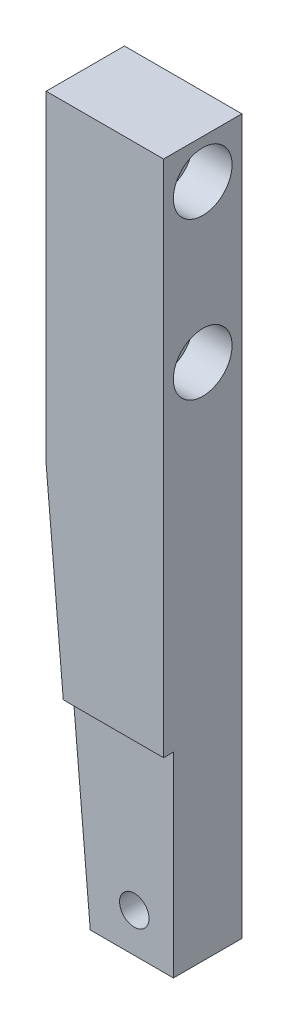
ISO-10303-21;
HEADER;
FILE_DESCRIPTION(('STEP AP214'),'2;1');
FILE_NAME('part.step','',(''),(''),'','','');
FILE_SCHEMA(('AUTOMOTIVE_DESIGN { 1 0 10303 214 1 1 1 1 }'));
ENDSEC;
DATA;
#1=APPLICATION_CONTEXT('core data for automotive mechanical design processes');
#2=APPLICATION_PROTOCOL_DEFINITION('international standard','automotive_design',2000,#1);
#3=PRODUCT_CONTEXT('',#1,'mechanical');
#4=PRODUCT('Part','Part','',(#3));
#5=PRODUCT_RELATED_PRODUCT_CATEGORY('part','',(#4));
#6=PRODUCT_DEFINITION_FORMATION('','',#4);
#7=PRODUCT_DEFINITION_CONTEXT('part definition',#1,'design');
#8=PRODUCT_DEFINITION('design','',#6,#7);
#9=PRODUCT_DEFINITION_SHAPE('','',#8);
#10=(LENGTH_UNIT() NAMED_UNIT(*) SI_UNIT(.MILLI.,.METRE.));
#11=(NAMED_UNIT(*) PLANE_ANGLE_UNIT() SI_UNIT($,.RADIAN.));
#12=(NAMED_UNIT(*) SI_UNIT($,.STERADIAN.) SOLID_ANGLE_UNIT());
#13=UNCERTAINTY_MEASURE_WITH_UNIT(LENGTH_MEASURE(1.E-05),#10,'distance_accuracy_value','');
#14=(GEOMETRIC_REPRESENTATION_CONTEXT(3) GLOBAL_UNCERTAINTY_ASSIGNED_CONTEXT((#13)) GLOBAL_UNIT_ASSIGNED_CONTEXT((#10,
#11,#12)) REPRESENTATION_CONTEXT('',''));
#15=CARTESIAN_POINT('',(0.,0.,0.));
#16=DIRECTION('',(0.,0.,1.));
#17=DIRECTION('',(1.,0.,0.));
#18=AXIS2_PLACEMENT_3D('',#15,#16,#17);
#19=CARTESIAN_POINT('',(0.,0.,6.35));
#20=DIRECTION('',(0.,0.,-1.));
#21=DIRECTION('',(-1.,0.,0.));
#22=AXIS2_PLACEMENT_3D('',#19,#20,#21);
#23=PLANE('',#22);
#24=DIRECTION('',(-1.,0.,0.));
#25=VECTOR('',#24,1.);
#26=CARTESIAN_POINT('',(0.,-84.1248,6.35));
#27=LINE('',#26,#25);
#28=CARTESIAN_POINT('',(19.05,-84.1248,6.35));
#29=VERTEX_POINT('',#28);
#30=CARTESIAN_POINT('',(2.7777650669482,-84.1248,6.35));
#31=VERTEX_POINT('',#30);
#32=EDGE_CURVE('E48',#29,#31,#27,.T.);
#33=ORIENTED_EDGE('',*,*,#32,.F.);
#34=DIRECTION('',(0.,1.,0.));
#35=VECTOR('',#34,1.);
#36=CARTESIAN_POINT('',(19.05,0.,6.35));
#37=LINE('',#36,#35);
#38=CARTESIAN_POINT('',(19.05,0.,6.35));
#39=VERTEX_POINT('',#38);
#40=EDGE_CURVE('E111',#29,#39,#37,.T.);
#41=ORIENTED_EDGE('',*,*,#40,.T.);
#42=DIRECTION('',(-1.,0.,0.));
#43=VECTOR('',#42,1.);
#44=CARTESIAN_POINT('',(0.,0.,6.35));
#45=LINE('',#44,#43);
#46=CARTESIAN_POINT('',(0.,0.,6.35));
#47=VERTEX_POINT('',#46);
#48=EDGE_CURVE('E147',#39,#47,#45,.T.);
#49=ORIENTED_EDGE('',*,*,#48,.T.);
#50=DIRECTION('',(0.,-1.,0.));
#51=VECTOR('',#50,1.);
#52=CARTESIAN_POINT('',(0.,-115.8748,6.35));
#53=LINE('',#52,#51);
#54=CARTESIAN_POINT('',(0.,-52.3747999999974,6.35));
#55=VERTEX_POINT('',#54);
#56=EDGE_CURVE('E150',#47,#55,#53,.T.);
#57=ORIENTED_EDGE('',*,*,#56,.T.);
#58=DIRECTION('',(-0.0871557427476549,0.996194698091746,0.));
#59=VECTOR('',#58,1.);
#60=CARTESIAN_POINT('',(5.55553013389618,-115.8748,6.35));
#61=LINE('',#60,#59);
#62=EDGE_CURVE('E173',#55,#31,#61,.F.);
#63=ORIENTED_EDGE('',*,*,#62,.T.);
#64=EDGE_LOOP('',(#33,#41,#49,#57,#63));
#65=FACE_BOUND('',#64,.T.);
#66=ADVANCED_FACE('F33',(#65),#23,.F.);
#67=CARTESIAN_POINT('',(19.05,0.,6.35));
#68=DIRECTION('',(-1.,0.,0.));
#69=DIRECTION('',(0.,-1.,0.));
#70=AXIS2_PLACEMENT_3D('',#67,#68,#69);
#71=PLANE('',#70);
#72=CARTESIAN_POINT('',(19.05,-31.75,0.));
#73=DIRECTION('',(1.,0.,0.));
#74=DIRECTION('',(0.,0.,-1.));
#75=AXIS2_PLACEMENT_3D('',#72,#73,#74);
#76=CIRCLE('',#75,4.7625);
#77=CARTESIAN_POINT('',(19.05,-31.75,-4.7625));
#78=VERTEX_POINT('',#77);
#79=EDGE_CURVE('E130',#78,#78,#76,.T.);
#80=ORIENTED_EDGE('',*,*,#79,.F.);
#81=EDGE_LOOP('',(#80));
#82=FACE_BOUND('',#81,.T.);
#83=CARTESIAN_POINT('',(19.05,-6.35,0.));
#84=DIRECTION('',(1.,0.,0.));
#85=DIRECTION('',(0.,0.,-1.));
#86=AXIS2_PLACEMENT_3D('',#83,#84,#85);
#87=CIRCLE('',#86,4.7625);
#88=CARTESIAN_POINT('',(19.05,-6.35,-4.7625));
#89=VERTEX_POINT('',#88);
#90=EDGE_CURVE('E118',#89,#89,#87,.T.);
#91=ORIENTED_EDGE('',*,*,#90,.F.);
#92=EDGE_LOOP('',(#91));
#93=FACE_BOUND('',#92,.T.);
#94=DIRECTION('',(0.,1.,0.));
#95=VECTOR('',#94,1.);
#96=CARTESIAN_POINT('',(19.05,0.,4.7498));
#97=LINE('',#96,#95);
#98=CARTESIAN_POINT('',(19.05,-115.8748,4.74979999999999));
#99=VERTEX_POINT('',#98);
#100=CARTESIAN_POINT('',(19.05,-84.1248,4.74979999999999));
#101=VERTEX_POINT('',#100);
#102=EDGE_CURVE('E94',#99,#101,#97,.T.);
#103=ORIENTED_EDGE('',*,*,#102,.F.);
#104=DIRECTION('',(0.,0.,-1.));
#105=VECTOR('',#104,1.);
#106=CARTESIAN_POINT('',(19.05,-115.8748,6.35));
#107=LINE('',#106,#105);
#108=CARTESIAN_POINT('',(19.05,-115.8748,-6.35));
#109=VERTEX_POINT('',#108);
#110=EDGE_CURVE('E152',#99,#109,#107,.T.);
#111=ORIENTED_EDGE('',*,*,#110,.T.);
#112=DIRECTION('',(0.,1.,0.));
#113=VECTOR('',#112,1.);
#114=CARTESIAN_POINT('',(19.05,0.,-6.35));
#115=LINE('',#114,#113);
#116=CARTESIAN_POINT('',(19.05,0.,-6.35));
#117=VERTEX_POINT('',#116);
#118=EDGE_CURVE('E145',#109,#117,#115,.T.);
#119=ORIENTED_EDGE('',*,*,#118,.T.);
#120=DIRECTION('',(0.,0.,-1.));
#121=VECTOR('',#120,1.);
#122=CARTESIAN_POINT('',(19.05,0.,6.35));
#123=LINE('',#122,#121);
#124=EDGE_CURVE('E165',#39,#117,#123,.T.);
#125=ORIENTED_EDGE('',*,*,#124,.F.);
#126=ORIENTED_EDGE('',*,*,#40,.F.);
#127=DIRECTION('',(0.,0.,1.));
#128=VECTOR('',#127,1.);
#129=CARTESIAN_POINT('',(19.05,-84.1248,6.35));
#130=LINE('',#129,#128);
#131=EDGE_CURVE('E106',#101,#29,#130,.T.);
#132=ORIENTED_EDGE('',*,*,#131,.F.);
#133=EDGE_LOOP('',(#103,#111,#119,#125,#126,#132));
#134=FACE_BOUND('',#133,.T.);
#135=ADVANCED_FACE('F109',(#82,#93,#134),#71,.F.);
#136=CARTESIAN_POINT('',(19.05,-115.8748,6.35));
#137=DIRECTION('',(0.,1.,0.));
#138=DIRECTION('',(0.,0.,1.));
#139=AXIS2_PLACEMENT_3D('',#136,#137,#138);
#140=PLANE('',#139);
#141=DIRECTION('',(1.,0.,0.));
#142=VECTOR('',#141,1.);
#143=CARTESIAN_POINT('',(19.05,-115.8748,4.74979999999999));
#144=LINE('',#143,#142);
#145=CARTESIAN_POINT('',(5.55553013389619,-115.8748,4.74979999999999));
#146=VERTEX_POINT('',#145);
#147=EDGE_CURVE('E99',#146,#99,#144,.T.);
#148=ORIENTED_EDGE('',*,*,#147,.F.);
#149=DIRECTION('',(0.,0.,-1.));
#150=VECTOR('',#149,1.);
#151=CARTESIAN_POINT('',(5.55553013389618,-115.8748,6.35));
#152=LINE('',#151,#150);
#153=CARTESIAN_POINT('',(5.55553013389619,-115.8748,-6.35));
#154=VERTEX_POINT('',#153);
#155=EDGE_CURVE('E168',#146,#154,#152,.T.);
#156=ORIENTED_EDGE('',*,*,#155,.T.);
#157=DIRECTION('',(1.,0.,0.));
#158=VECTOR('',#157,1.);
#159=CARTESIAN_POINT('',(19.05,-115.8748,-6.35));
#160=LINE('',#159,#158);
#161=EDGE_CURVE('E148',#154,#109,#160,.T.);
#162=ORIENTED_EDGE('',*,*,#161,.T.);
#163=ORIENTED_EDGE('',*,*,#110,.F.);
#164=EDGE_LOOP('',(#148,#156,#162,#163));
#165=FACE_BOUND('',#164,.T.);
#166=ADVANCED_FACE('F191',(#165),#140,.F.);
#167=CARTESIAN_POINT('',(12.7,-109.5248,6.35));
#168=DIRECTION('',(0.,0.,-1.));
#169=DIRECTION('',(-1.,0.,0.));
#170=AXIS2_PLACEMENT_3D('',#167,#168,#169);
#171=CYLINDRICAL_SURFACE('',#170,2.3876);
#172=CARTESIAN_POINT('',(12.7,-109.5248,-6.35));
#173=DIRECTION('',(0.,0.,1.));
#174=DIRECTION('',(1.,0.,0.));
#175=AXIS2_PLACEMENT_3D('',#172,#173,#174);
#176=CIRCLE('',#175,2.3876);
#177=CARTESIAN_POINT('',(15.0876,-109.5248,-6.35));
#178=VERTEX_POINT('',#177);
#179=EDGE_CURVE('E142',#178,#178,#176,.T.);
#180=ORIENTED_EDGE('',*,*,#179,.F.);
#181=EDGE_LOOP('',(#180));
#182=FACE_BOUND('',#181,.T.);
#183=CARTESIAN_POINT('',(12.7,-109.5248,4.74979999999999));
#184=DIRECTION('',(0.,0.,1.));
#185=DIRECTION('',(0.,-1.,0.));
#186=AXIS2_PLACEMENT_3D('',#183,#184,#185);
#187=CIRCLE('',#186,2.3876);
#188=CARTESIAN_POINT('',(12.7,-111.9124,4.74979999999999));
#189=VERTEX_POINT('',#188);
#190=EDGE_CURVE('E103',#189,#189,#187,.T.);
#191=ORIENTED_EDGE('',*,*,#190,.T.);
#192=EDGE_LOOP('',(#191));
#193=FACE_BOUND('',#192,.T.);
#194=ADVANCED_FACE('F210',(#182,#193),#171,.F.);
#195=CARTESIAN_POINT('',(5.55553013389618,-115.8748,6.35));
#196=DIRECTION('',(0.996194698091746,0.0871557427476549,0.));
#197=DIRECTION('',(0.,0.,-1.));
#198=AXIS2_PLACEMENT_3D('',#195,#196,#197);
#199=PLANE('',#198);
#200=ORIENTED_EDGE('',*,*,#155,.F.);
#201=DIRECTION('',(0.0871557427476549,-0.996194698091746,0.));
#202=VECTOR('',#201,1.);
#203=CARTESIAN_POINT('',(5.55553013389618,-115.8748,4.74979999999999));
#204=LINE('',#203,#202);
#205=CARTESIAN_POINT('',(2.77776506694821,-84.1248,4.74979999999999));
#206=VERTEX_POINT('',#205);
#207=EDGE_CURVE('E11',#146,#206,#204,.F.);
#208=ORIENTED_EDGE('',*,*,#207,.T.);
#209=DIRECTION('',(0.,0.,-1.));
#210=VECTOR('',#209,1.);
#211=CARTESIAN_POINT('',(2.7777650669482,-84.1248,6.35));
#212=LINE('',#211,#210);
#213=EDGE_CURVE('E41',#206,#31,#212,.F.);
#214=ORIENTED_EDGE('',*,*,#213,.T.);
#215=ORIENTED_EDGE('',*,*,#62,.F.);
#216=DIRECTION('',(0.,0.,1.));
#217=VECTOR('',#216,1.);
#218=CARTESIAN_POINT('',(0.,-52.3747999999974,6.35));
#219=LINE('',#218,#217);
#220=CARTESIAN_POINT('',(0.,-52.3747999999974,-6.35));
#221=VERTEX_POINT('',#220);
#222=EDGE_CURVE('E56',#221,#55,#219,.T.);
#223=ORIENTED_EDGE('',*,*,#222,.F.);
#224=DIRECTION('',(0.0871557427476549,-0.996194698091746,0.));
#225=VECTOR('',#224,1.);
#226=CARTESIAN_POINT('',(-4.54739428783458,-0.397845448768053,-6.35));
#227=LINE('',#226,#225);
#228=EDGE_CURVE('E170',#154,#221,#227,.F.);
#229=ORIENTED_EDGE('',*,*,#228,.F.);
#230=EDGE_LOOP('',(#200,#208,#214,#215,#223,#229));
#231=FACE_BOUND('',#230,.T.);
#232=ADVANCED_FACE('F35',(#231),#199,.F.);
#233=CARTESIAN_POINT('',(0.,0.,-6.35));
#234=DIRECTION('',(0.,0.,-1.));
#235=DIRECTION('',(-1.,0.,0.));
#236=AXIS2_PLACEMENT_3D('',#233,#234,#235);
#237=PLANE('',#236);
#238=ORIENTED_EDGE('',*,*,#161,.F.);
#239=ORIENTED_EDGE('',*,*,#228,.T.);
#240=DIRECTION('',(0.,-1.,0.));
#241=VECTOR('',#240,1.);
#242=CARTESIAN_POINT('',(0.,-115.8748,-6.35));
#243=LINE('',#242,#241);
#244=CARTESIAN_POINT('',(0.,0.,-6.35));
#245=VERTEX_POINT('',#244);
#246=EDGE_CURVE('E157',#245,#221,#243,.T.);
#247=ORIENTED_EDGE('',*,*,#246,.F.);
#248=DIRECTION('',(-1.,0.,0.));
#249=VECTOR('',#248,1.);
#250=CARTESIAN_POINT('',(0.,0.,-6.35));
#251=LINE('',#250,#249);
#252=EDGE_CURVE('E155',#117,#245,#251,.T.);
#253=ORIENTED_EDGE('',*,*,#252,.F.);
#254=ORIENTED_EDGE('',*,*,#118,.F.);
#255=EDGE_LOOP('',(#238,#239,#247,#253,#254));
#256=FACE_BOUND('',#255,.T.);
#257=ORIENTED_EDGE('',*,*,#179,.T.);
#258=EDGE_LOOP('',(#257));
#259=FACE_BOUND('',#258,.T.);
#260=ADVANCED_FACE('F186',(#256,#259),#237,.T.);
#261=CARTESIAN_POINT('',(0.,0.,6.35));
#262=DIRECTION('',(0.,-1.,0.));
#263=DIRECTION('',(0.,0.,-1.));
#264=AXIS2_PLACEMENT_3D('',#261,#262,#263);
#265=PLANE('',#264);
#266=ORIENTED_EDGE('',*,*,#252,.T.);
#267=DIRECTION('',(0.,0.,-1.));
#268=VECTOR('',#267,1.);
#269=CARTESIAN_POINT('',(0.,0.,6.35));
#270=LINE('',#269,#268);
#271=EDGE_CURVE('E162',#47,#245,#270,.T.);
#272=ORIENTED_EDGE('',*,*,#271,.F.);
#273=ORIENTED_EDGE('',*,*,#48,.F.);
#274=ORIENTED_EDGE('',*,*,#124,.T.);
#275=EDGE_LOOP('',(#266,#272,#273,#274));
#276=FACE_BOUND('',#275,.T.);
#277=ADVANCED_FACE('F192',(#276),#265,.F.);
#278=CARTESIAN_POINT('',(0.,-115.8748,6.35));
#279=DIRECTION('',(1.,0.,0.));
#280=DIRECTION('',(0.,0.,-1.));
#281=AXIS2_PLACEMENT_3D('',#278,#279,#280);
#282=PLANE('',#281);
#283=CARTESIAN_POINT('',(0.,-6.35,0.));
#284=DIRECTION('',(1.,0.,0.));
#285=DIRECTION('',(0.,0.,-1.));
#286=AXIS2_PLACEMENT_3D('',#283,#284,#285);
#287=CIRCLE('',#286,3.175);
#288=CARTESIAN_POINT('',(0.,-6.35,-3.175));
#289=VERTEX_POINT('',#288);
#290=EDGE_CURVE('E127',#289,#289,#287,.T.);
#291=ORIENTED_EDGE('',*,*,#290,.T.);
#292=EDGE_LOOP('',(#291));
#293=FACE_BOUND('',#292,.T.);
#294=CARTESIAN_POINT('',(0.,-31.75,0.));
#295=DIRECTION('',(1.,0.,0.));
#296=DIRECTION('',(0.,0.,-1.));
#297=AXIS2_PLACEMENT_3D('',#294,#295,#296);
#298=CIRCLE('',#297,3.175);
#299=CARTESIAN_POINT('',(0.,-31.75,-3.175));
#300=VERTEX_POINT('',#299);
#301=EDGE_CURVE('E139',#300,#300,#298,.T.);
#302=ORIENTED_EDGE('',*,*,#301,.T.);
#303=EDGE_LOOP('',(#302));
#304=FACE_BOUND('',#303,.T.);
#305=ORIENTED_EDGE('',*,*,#246,.T.);
#306=ORIENTED_EDGE('',*,*,#222,.T.);
#307=ORIENTED_EDGE('',*,*,#56,.F.);
#308=ORIENTED_EDGE('',*,*,#271,.T.);
#309=EDGE_LOOP('',(#305,#306,#307,#308));
#310=FACE_BOUND('',#309,.T.);
#311=ADVANCED_FACE('F181',(#293,#304,#310),#282,.F.);
#312=CARTESIAN_POINT('',(19.05,-31.75,0.));
#313=DIRECTION('',(1.,0.,0.));
#314=DIRECTION('',(0.,0.,-1.));
#315=AXIS2_PLACEMENT_3D('',#312,#313,#314);
#316=CYLINDRICAL_SURFACE('',#315,3.175);
#317=ORIENTED_EDGE('',*,*,#301,.F.);
#318=EDGE_LOOP('',(#317));
#319=FACE_BOUND('',#318,.T.);
#320=CARTESIAN_POINT('',(12.7,-31.75,0.));
#321=DIRECTION('',(1.,0.,0.));
#322=DIRECTION('',(0.,0.,-1.));
#323=AXIS2_PLACEMENT_3D('',#320,#321,#322);
#324=CIRCLE('',#323,3.175);
#325=CARTESIAN_POINT('',(12.7,-31.75,-3.175));
#326=VERTEX_POINT('',#325);
#327=EDGE_CURVE('E136',#326,#326,#324,.T.);
#328=ORIENTED_EDGE('',*,*,#327,.T.);
#329=EDGE_LOOP('',(#328));
#330=FACE_BOUND('',#329,.T.);
#331=ADVANCED_FACE('F199',(#319,#330),#316,.F.);
#332=CARTESIAN_POINT('',(12.7,-28.575,0.));
#333=DIRECTION('',(-1.,0.,0.));
#334=DIRECTION('',(0.,0.,1.));
#335=AXIS2_PLACEMENT_3D('',#332,#333,#334);
#336=PLANE('',#335);
#337=ORIENTED_EDGE('',*,*,#327,.F.);
#338=EDGE_LOOP('',(#337));
#339=FACE_BOUND('',#338,.T.);
#340=CARTESIAN_POINT('',(12.7,-31.75,0.));
#341=DIRECTION('',(1.,0.,0.));
#342=DIRECTION('',(0.,0.,-1.));
#343=AXIS2_PLACEMENT_3D('',#340,#341,#342);
#344=CIRCLE('',#343,4.7625);
#345=CARTESIAN_POINT('',(12.7,-31.75,-4.7625));
#346=VERTEX_POINT('',#345);
#347=EDGE_CURVE('E133',#346,#346,#344,.T.);
#348=ORIENTED_EDGE('',*,*,#347,.T.);
#349=EDGE_LOOP('',(#348));
#350=FACE_BOUND('',#349,.T.);
#351=ADVANCED_FACE('F247',(#339,#350),#336,.F.);
#352=CARTESIAN_POINT('',(19.05,-31.75,0.));
#353=DIRECTION('',(1.,0.,0.));
#354=DIRECTION('',(0.,0.,-1.));
#355=AXIS2_PLACEMENT_3D('',#352,#353,#354);
#356=CYLINDRICAL_SURFACE('',#355,4.7625);
#357=ORIENTED_EDGE('',*,*,#347,.F.);
#358=EDGE_LOOP('',(#357));
#359=FACE_BOUND('',#358,.T.);
#360=ORIENTED_EDGE('',*,*,#79,.T.);
#361=EDGE_LOOP('',(#360));
#362=FACE_BOUND('',#361,.T.);
#363=ADVANCED_FACE('F243',(#359,#362),#356,.F.);
#364=CARTESIAN_POINT('',(19.05,-6.35,0.));
#365=DIRECTION('',(1.,0.,0.));
#366=DIRECTION('',(0.,0.,-1.));
#367=AXIS2_PLACEMENT_3D('',#364,#365,#366);
#368=CYLINDRICAL_SURFACE('',#367,3.175);
#369=ORIENTED_EDGE('',*,*,#290,.F.);
#370=EDGE_LOOP('',(#369));
#371=FACE_BOUND('',#370,.T.);
#372=CARTESIAN_POINT('',(12.7,-6.35,0.));
#373=DIRECTION('',(1.,0.,0.));
#374=DIRECTION('',(0.,0.,-1.));
#375=AXIS2_PLACEMENT_3D('',#372,#373,#374);
#376=CIRCLE('',#375,3.175);
#377=CARTESIAN_POINT('',(12.7,-6.35,-3.175));
#378=VERTEX_POINT('',#377);
#379=EDGE_CURVE('E124',#378,#378,#376,.T.);
#380=ORIENTED_EDGE('',*,*,#379,.T.);
#381=EDGE_LOOP('',(#380));
#382=FACE_BOUND('',#381,.T.);
#383=ADVANCED_FACE('F239',(#371,#382),#368,.F.);
#384=CARTESIAN_POINT('',(12.7,-3.175,0.));
#385=DIRECTION('',(-1.,0.,0.));
#386=DIRECTION('',(0.,0.,1.));
#387=AXIS2_PLACEMENT_3D('',#384,#385,#386);
#388=PLANE('',#387);
#389=ORIENTED_EDGE('',*,*,#379,.F.);
#390=EDGE_LOOP('',(#389));
#391=FACE_BOUND('',#390,.T.);
#392=CARTESIAN_POINT('',(12.7,-6.35,0.));
#393=DIRECTION('',(1.,0.,0.));
#394=DIRECTION('',(0.,0.,-1.));
#395=AXIS2_PLACEMENT_3D('',#392,#393,#394);
#396=CIRCLE('',#395,4.7625);
#397=CARTESIAN_POINT('',(12.7,-6.35,-4.7625));
#398=VERTEX_POINT('',#397);
#399=EDGE_CURVE('E121',#398,#398,#396,.T.);
#400=ORIENTED_EDGE('',*,*,#399,.T.);
#401=EDGE_LOOP('',(#400));
#402=FACE_BOUND('',#401,.T.);
#403=ADVANCED_FACE('F233',(#391,#402),#388,.F.);
#404=CARTESIAN_POINT('',(19.05,-6.35,0.));
#405=DIRECTION('',(1.,0.,0.));
#406=DIRECTION('',(0.,0.,-1.));
#407=AXIS2_PLACEMENT_3D('',#404,#405,#406);
#408=CYLINDRICAL_SURFACE('',#407,4.7625);
#409=ORIENTED_EDGE('',*,*,#399,.F.);
#410=EDGE_LOOP('',(#409));
#411=FACE_BOUND('',#410,.T.);
#412=ORIENTED_EDGE('',*,*,#90,.T.);
#413=EDGE_LOOP('',(#412));
#414=FACE_BOUND('',#413,.T.);
#415=ADVANCED_FACE('F226',(#411,#414),#408,.F.);
#416=CARTESIAN_POINT('',(30.48,-84.1248,4.74979999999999));
#417=DIRECTION('',(0.,0.,1.));
#418=DIRECTION('',(0.,-1.,0.));
#419=AXIS2_PLACEMENT_3D('',#416,#417,#418);
#420=PLANE('',#419);
#421=ORIENTED_EDGE('',*,*,#190,.F.);
#422=EDGE_LOOP('',(#421));
#423=FACE_BOUND('',#422,.T.);
#424=ORIENTED_EDGE('',*,*,#102,.T.);
#425=DIRECTION('',(-1.,0.,0.));
#426=VECTOR('',#425,1.);
#427=CARTESIAN_POINT('',(30.48,-84.1248,4.74979999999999));
#428=LINE('',#427,#426);
#429=EDGE_CURVE('E97',#101,#206,#428,.T.);
#430=ORIENTED_EDGE('',*,*,#429,.T.);
#431=ORIENTED_EDGE('',*,*,#207,.F.);
#432=ORIENTED_EDGE('',*,*,#147,.T.);
#433=EDGE_LOOP('',(#424,#430,#431,#432));
#434=FACE_BOUND('',#433,.T.);
#435=ADVANCED_FACE('F96',(#423,#434),#420,.T.);
#436=CARTESIAN_POINT('',(30.48,-84.1248,14.9098));
#437=DIRECTION('',(0.,-1.,0.));
#438=DIRECTION('',(0.,0.,-1.));
#439=AXIS2_PLACEMENT_3D('',#436,#437,#438);
#440=PLANE('',#439);
#441=ORIENTED_EDGE('',*,*,#131,.T.);
#442=ORIENTED_EDGE('',*,*,#32,.T.);
#443=ORIENTED_EDGE('',*,*,#213,.F.);
#444=ORIENTED_EDGE('',*,*,#429,.F.);
#445=EDGE_LOOP('',(#441,#442,#443,#444));
#446=FACE_BOUND('',#445,.T.);
#447=ADVANCED_FACE('F105',(#446),#440,.T.);
#448=CLOSED_SHELL('',(#66,#135,#166,#194,#232,#260,#277,#311,#331,#351,#363,#383,#403,#415,#435,#447));
#449=MANIFOLD_SOLID_BREP('B2',#448);
#450=ADVANCED_BREP_SHAPE_REPRESENTATION('',(#18,#449),#14);
#451=SHAPE_DEFINITION_REPRESENTATION(#9,#450);
ENDSEC;
END-ISO-10303-21;
